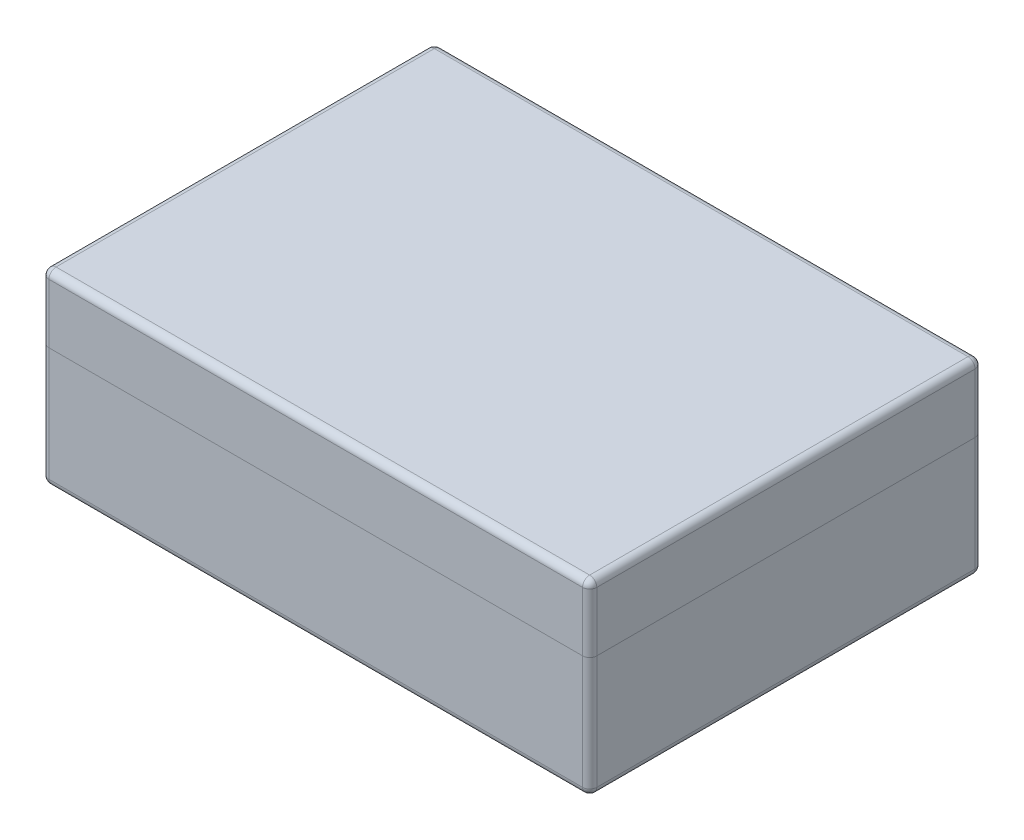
ISO-10303-21;
HEADER;
FILE_DESCRIPTION(('STEP AP214'),'2;1');
FILE_NAME('part.step','',(''),(''),'','','');
FILE_SCHEMA(('AUTOMOTIVE_DESIGN { 1 0 10303 214 1 1 1 1 }'));
ENDSEC;
DATA;
#1=APPLICATION_CONTEXT('core data for automotive mechanical design processes');
#2=APPLICATION_PROTOCOL_DEFINITION('international standard','automotive_design',2000,#1);
#3=PRODUCT_CONTEXT('',#1,'mechanical');
#4=PRODUCT('Part','Part','',(#3));
#5=PRODUCT_RELATED_PRODUCT_CATEGORY('part','',(#4));
#6=PRODUCT_DEFINITION_FORMATION('','',#4);
#7=PRODUCT_DEFINITION_CONTEXT('part definition',#1,'design');
#8=PRODUCT_DEFINITION('design','',#6,#7);
#9=PRODUCT_DEFINITION_SHAPE('','',#8);
#10=(LENGTH_UNIT() NAMED_UNIT(*) SI_UNIT(.MILLI.,.METRE.));
#11=(NAMED_UNIT(*) PLANE_ANGLE_UNIT() SI_UNIT($,.RADIAN.));
#12=(NAMED_UNIT(*) SI_UNIT($,.STERADIAN.) SOLID_ANGLE_UNIT());
#13=UNCERTAINTY_MEASURE_WITH_UNIT(LENGTH_MEASURE(1.E-05),#10,'distance_accuracy_value','');
#14=(GEOMETRIC_REPRESENTATION_CONTEXT(3) GLOBAL_UNCERTAINTY_ASSIGNED_CONTEXT((#13)) GLOBAL_UNIT_ASSIGNED_CONTEXT((#10,
#11,#12)) REPRESENTATION_CONTEXT('',''));
#15=CARTESIAN_POINT('',(0.,0.,0.));
#16=DIRECTION('',(0.,0.,1.));
#17=DIRECTION('',(1.,0.,0.));
#18=AXIS2_PLACEMENT_3D('',#15,#16,#17);
#19=CARTESIAN_POINT('',(0.,102.,0.));
#20=DIRECTION('',(0.,1.,0.));
#21=DIRECTION('',(0.,0.,1.));
#22=AXIS2_PLACEMENT_3D('',#19,#20,#21);
#23=PLANE('',#22);
#24=DIRECTION('',(0.,0.,-1.));
#25=VECTOR('',#24,1.);
#26=CARTESIAN_POINT('',(221.,102.,-155.5));
#27=LINE('',#26,#25);
#28=CARTESIAN_POINT('',(221.,102.,155.5));
#29=VERTEX_POINT('',#28);
#30=CARTESIAN_POINT('',(221.,102.,-155.5));
#31=VERTEX_POINT('',#30);
#32=EDGE_CURVE('E227',#29,#31,#27,.T.);
#33=ORIENTED_EDGE('',*,*,#32,.F.);
#34=DIRECTION('',(1.,0.,0.));
#35=VECTOR('',#34,1.);
#36=CARTESIAN_POINT('',(221.,102.,155.5));
#37=LINE('',#36,#35);
#38=CARTESIAN_POINT('',(-221.,102.,155.5));
#39=VERTEX_POINT('',#38);
#40=EDGE_CURVE('E179',#39,#29,#37,.T.);
#41=ORIENTED_EDGE('',*,*,#40,.F.);
#42=DIRECTION('',(0.,0.,1.));
#43=VECTOR('',#42,1.);
#44=CARTESIAN_POINT('',(-221.,102.,-155.5));
#45=LINE('',#44,#43);
#46=CARTESIAN_POINT('',(-221.,102.,-155.5));
#47=VERTEX_POINT('',#46);
#48=EDGE_CURVE('E223',#47,#39,#45,.T.);
#49=ORIENTED_EDGE('',*,*,#48,.F.);
#50=DIRECTION('',(-1.,0.,0.));
#51=VECTOR('',#50,1.);
#52=CARTESIAN_POINT('',(221.,102.,-155.5));
#53=LINE('',#52,#51);
#54=EDGE_CURVE('E225',#31,#47,#53,.T.);
#55=ORIENTED_EDGE('',*,*,#54,.F.);
#56=EDGE_LOOP('',(#33,#41,#49,#55));
#57=FACE_BOUND('',#56,.T.);
#58=CARTESIAN_POINT('',(225.,102.,159.5));
#59=DIRECTION('',(0.,1.,0.));
#60=DIRECTION('',(0.,0.,1.));
#61=AXIS2_PLACEMENT_3D('',#58,#59,#60);
#62=CIRCLE('',#61,6.);
#63=CARTESIAN_POINT('',(231.,102.,159.5));
#64=VERTEX_POINT('',#63);
#65=CARTESIAN_POINT('',(225.,102.,165.5));
#66=VERTEX_POINT('',#65);
#67=EDGE_CURVE('E150',#64,#66,#62,.F.);
#68=ORIENTED_EDGE('',*,*,#67,.F.);
#69=DIRECTION('',(0.,0.,-1.));
#70=VECTOR('',#69,1.);
#71=CARTESIAN_POINT('',(231.,102.,165.5));
#72=LINE('',#71,#70);
#73=CARTESIAN_POINT('',(231.,102.,-159.5));
#74=VERTEX_POINT('',#73);
#75=EDGE_CURVE('E152',#64,#74,#72,.T.);
#76=ORIENTED_EDGE('',*,*,#75,.T.);
#77=CARTESIAN_POINT('',(225.,102.,-159.5));
#78=DIRECTION('',(0.,1.,0.));
#79=DIRECTION('',(0.,0.,1.));
#80=AXIS2_PLACEMENT_3D('',#77,#78,#79);
#81=CIRCLE('',#80,6.);
#82=CARTESIAN_POINT('',(225.,102.,-165.5));
#83=VERTEX_POINT('',#82);
#84=EDGE_CURVE('E231',#83,#74,#81,.F.);
#85=ORIENTED_EDGE('',*,*,#84,.F.);
#86=DIRECTION('',(-1.,0.,0.));
#87=VECTOR('',#86,1.);
#88=CARTESIAN_POINT('',(-231.,102.,-165.5));
#89=LINE('',#88,#87);
#90=CARTESIAN_POINT('',(-225.,102.,-165.5));
#91=VERTEX_POINT('',#90);
#92=EDGE_CURVE('E169',#83,#91,#89,.T.);
#93=ORIENTED_EDGE('',*,*,#92,.T.);
#94=CARTESIAN_POINT('',(-225.,102.,-159.5));
#95=DIRECTION('',(0.,1.,0.));
#96=DIRECTION('',(0.,0.,1.));
#97=AXIS2_PLACEMENT_3D('',#94,#95,#96);
#98=CIRCLE('',#97,6.);
#99=CARTESIAN_POINT('',(-231.,102.,-159.5));
#100=VERTEX_POINT('',#99);
#101=EDGE_CURVE('E229',#100,#91,#98,.F.);
#102=ORIENTED_EDGE('',*,*,#101,.F.);
#103=DIRECTION('',(0.,0.,1.));
#104=VECTOR('',#103,1.);
#105=CARTESIAN_POINT('',(-231.,102.,165.5));
#106=LINE('',#105,#104);
#107=CARTESIAN_POINT('',(-231.,102.,159.5));
#108=VERTEX_POINT('',#107);
#109=EDGE_CURVE('E161',#100,#108,#106,.T.);
#110=ORIENTED_EDGE('',*,*,#109,.T.);
#111=CARTESIAN_POINT('',(-225.,102.,159.5));
#112=DIRECTION('',(0.,1.,0.));
#113=DIRECTION('',(0.,0.,1.));
#114=AXIS2_PLACEMENT_3D('',#111,#112,#113);
#115=CIRCLE('',#114,6.);
#116=CARTESIAN_POINT('',(-225.,102.,165.5));
#117=VERTEX_POINT('',#116);
#118=EDGE_CURVE('E160',#117,#108,#115,.F.);
#119=ORIENTED_EDGE('',*,*,#118,.F.);
#120=DIRECTION('',(1.,0.,0.));
#121=VECTOR('',#120,1.);
#122=CARTESIAN_POINT('',(-231.,102.,165.5));
#123=LINE('',#122,#121);
#124=EDGE_CURVE('E155',#117,#66,#123,.T.);
#125=ORIENTED_EDGE('',*,*,#124,.T.);
#126=EDGE_LOOP('',(#68,#76,#85,#93,#102,#110,#119,#125));
#127=FACE_BOUND('',#126,.T.);
#128=ADVANCED_FACE('F44',(#57,#127),#23,.T.);
#129=CARTESIAN_POINT('',(221.,147.,-155.5));
#130=DIRECTION('',(0.,0.,1.));
#131=DIRECTION('',(1.,0.,0.));
#132=AXIS2_PLACEMENT_3D('',#129,#130,#131);
#133=PLANE('',#132);
#134=DIRECTION('',(0.,-1.,0.));
#135=VECTOR('',#134,1.);
#136=CARTESIAN_POINT('',(221.,147.,-155.5));
#137=LINE('',#136,#135);
#138=CARTESIAN_POINT('',(221.,7.99999999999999,-155.5));
#139=VERTEX_POINT('',#138);
#140=EDGE_CURVE('E61',#31,#139,#137,.T.);
#141=ORIENTED_EDGE('',*,*,#140,.F.);
#142=ORIENTED_EDGE('',*,*,#54,.T.);
#143=DIRECTION('',(0.,-1.,0.));
#144=VECTOR('',#143,1.);
#145=CARTESIAN_POINT('',(-221.,147.,-155.5));
#146=LINE('',#145,#144);
#147=CARTESIAN_POINT('',(-221.,7.99999999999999,-155.5));
#148=VERTEX_POINT('',#147);
#149=EDGE_CURVE('E68',#47,#148,#146,.T.);
#150=ORIENTED_EDGE('',*,*,#149,.T.);
#151=DIRECTION('',(-1.,0.,0.));
#152=VECTOR('',#151,1.);
#153=CARTESIAN_POINT('',(221.,7.99999999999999,-155.5));
#154=LINE('',#153,#152);
#155=EDGE_CURVE('E53',#139,#148,#154,.T.);
#156=ORIENTED_EDGE('',*,*,#155,.F.);
#157=EDGE_LOOP('',(#141,#142,#150,#156));
#158=FACE_BOUND('',#157,.T.);
#159=ADVANCED_FACE('F338',(#158),#133,.T.);
#160=CARTESIAN_POINT('',(0.,7.99999999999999,0.));
#161=DIRECTION('',(0.,-1.,0.));
#162=DIRECTION('',(0.,0.,-1.));
#163=AXIS2_PLACEMENT_3D('',#160,#161,#162);
#164=PLANE('',#163);
#165=DIRECTION('',(0.,0.,-1.));
#166=VECTOR('',#165,1.);
#167=CARTESIAN_POINT('',(221.,7.99999999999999,-155.5));
#168=LINE('',#167,#166);
#169=CARTESIAN_POINT('',(221.,7.99999999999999,155.5));
#170=VERTEX_POINT('',#169);
#171=EDGE_CURVE('E12',#170,#139,#168,.T.);
#172=ORIENTED_EDGE('',*,*,#171,.T.);
#173=ORIENTED_EDGE('',*,*,#155,.T.);
#174=DIRECTION('',(0.,0.,1.));
#175=VECTOR('',#174,1.);
#176=CARTESIAN_POINT('',(-221.,7.99999999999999,-155.5));
#177=LINE('',#176,#175);
#178=CARTESIAN_POINT('',(-221.,7.99999999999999,155.5));
#179=VERTEX_POINT('',#178);
#180=EDGE_CURVE('E213',#148,#179,#177,.T.);
#181=ORIENTED_EDGE('',*,*,#180,.T.);
#182=DIRECTION('',(1.,0.,0.));
#183=VECTOR('',#182,1.);
#184=CARTESIAN_POINT('',(221.,7.99999999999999,155.5));
#185=LINE('',#184,#183);
#186=EDGE_CURVE('E208',#179,#170,#185,.T.);
#187=ORIENTED_EDGE('',*,*,#186,.T.);
#188=EDGE_LOOP('',(#172,#173,#181,#187));
#189=FACE_BOUND('',#188,.T.);
#190=ADVANCED_FACE('F340',(#189),#164,.F.);
#191=CARTESIAN_POINT('',(221.,147.,-155.5));
#192=DIRECTION('',(-1.,0.,0.));
#193=DIRECTION('',(0.,0.,1.));
#194=AXIS2_PLACEMENT_3D('',#191,#192,#193);
#195=PLANE('',#194);
#196=DIRECTION('',(0.,-1.,0.));
#197=VECTOR('',#196,1.);
#198=CARTESIAN_POINT('',(221.,147.,155.5));
#199=LINE('',#198,#197);
#200=EDGE_CURVE('E48',#29,#170,#199,.T.);
#201=ORIENTED_EDGE('',*,*,#200,.F.);
#202=ORIENTED_EDGE('',*,*,#32,.T.);
#203=ORIENTED_EDGE('',*,*,#140,.T.);
#204=ORIENTED_EDGE('',*,*,#171,.F.);
#205=EDGE_LOOP('',(#201,#202,#203,#204));
#206=FACE_BOUND('',#205,.T.);
#207=ADVANCED_FACE('F346',(#206),#195,.T.);
#208=CARTESIAN_POINT('',(-221.,147.,-155.5));
#209=DIRECTION('',(1.,0.,0.));
#210=DIRECTION('',(0.,0.,-1.));
#211=AXIS2_PLACEMENT_3D('',#208,#209,#210);
#212=PLANE('',#211);
#213=ORIENTED_EDGE('',*,*,#149,.F.);
#214=ORIENTED_EDGE('',*,*,#48,.T.);
#215=DIRECTION('',(0.,-1.,0.));
#216=VECTOR('',#215,1.);
#217=CARTESIAN_POINT('',(-221.,147.,155.5));
#218=LINE('',#217,#216);
#219=EDGE_CURVE('E203',#39,#179,#218,.T.);
#220=ORIENTED_EDGE('',*,*,#219,.T.);
#221=ORIENTED_EDGE('',*,*,#180,.F.);
#222=EDGE_LOOP('',(#213,#214,#220,#221));
#223=FACE_BOUND('',#222,.T.);
#224=ADVANCED_FACE('F352',(#223),#212,.T.);
#225=CARTESIAN_POINT('',(221.,147.,155.5));
#226=DIRECTION('',(0.,0.,-1.));
#227=DIRECTION('',(-1.,0.,0.));
#228=AXIS2_PLACEMENT_3D('',#225,#226,#227);
#229=PLANE('',#228);
#230=ORIENTED_EDGE('',*,*,#219,.F.);
#231=ORIENTED_EDGE('',*,*,#40,.T.);
#232=ORIENTED_EDGE('',*,*,#200,.T.);
#233=ORIENTED_EDGE('',*,*,#186,.F.);
#234=EDGE_LOOP('',(#230,#231,#232,#233));
#235=FACE_BOUND('',#234,.T.);
#236=ADVANCED_FACE('F355',(#235),#229,.T.);
#237=CARTESIAN_POINT('',(0.,0.,0.));
#238=DIRECTION('',(0.,-1.,0.));
#239=DIRECTION('',(0.,0.,-1.));
#240=AXIS2_PLACEMENT_3D('',#237,#238,#239);
#241=PLANE('',#240);
#242=DIRECTION('',(0.,0.,1.));
#243=VECTOR('',#242,1.);
#244=CARTESIAN_POINT('',(-225.,0.,-165.5));
#245=LINE('',#244,#243);
#246=CARTESIAN_POINT('',(-225.,0.,159.5));
#247=VERTEX_POINT('',#246);
#248=CARTESIAN_POINT('',(-225.,0.,-159.5));
#249=VERTEX_POINT('',#248);
#250=EDGE_CURVE('E263',#247,#249,#245,.F.);
#251=ORIENTED_EDGE('',*,*,#250,.T.);
#252=DIRECTION('',(-1.,0.,0.));
#253=VECTOR('',#252,1.);
#254=CARTESIAN_POINT('',(231.,0.,-159.5));
#255=LINE('',#254,#253);
#256=CARTESIAN_POINT('',(225.,0.,-159.5));
#257=VERTEX_POINT('',#256);
#258=EDGE_CURVE('E193',#249,#257,#255,.F.);
#259=ORIENTED_EDGE('',*,*,#258,.T.);
#260=DIRECTION('',(0.,0.,-1.));
#261=VECTOR('',#260,1.);
#262=CARTESIAN_POINT('',(225.,0.,165.5));
#263=LINE('',#262,#261);
#264=CARTESIAN_POINT('',(225.,0.,159.5));
#265=VERTEX_POINT('',#264);
#266=EDGE_CURVE('E291',#257,#265,#263,.F.);
#267=ORIENTED_EDGE('',*,*,#266,.T.);
#268=DIRECTION('',(1.,0.,0.));
#269=VECTOR('',#268,1.);
#270=CARTESIAN_POINT('',(-231.,0.,159.5));
#271=LINE('',#270,#269);
#272=EDGE_CURVE('E290',#265,#247,#271,.F.);
#273=ORIENTED_EDGE('',*,*,#272,.T.);
#274=EDGE_LOOP('',(#251,#259,#267,#273));
#275=FACE_BOUND('',#274,.T.);
#276=ADVANCED_FACE('F320',(#275),#241,.T.);
#277=CARTESIAN_POINT('',(-225.,6.00000000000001,165.5));
#278=DIRECTION('',(0.,0.,-1.));
#279=DIRECTION('',(-1.,0.,0.));
#280=AXIS2_PLACEMENT_3D('',#277,#278,#279);
#281=CYLINDRICAL_SURFACE('',#280,6.);
#282=CARTESIAN_POINT('',(-225.,6.00000000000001,159.5));
#283=DIRECTION('',(0.,0.,1.));
#284=DIRECTION('',(1.,0.,0.));
#285=AXIS2_PLACEMENT_3D('',#282,#283,#284);
#286=CIRCLE('',#285,6.);
#287=CARTESIAN_POINT('',(-231.,6.00000000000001,159.5));
#288=VERTEX_POINT('',#287);
#289=EDGE_CURVE('E255',#247,#288,#286,.F.);
#290=ORIENTED_EDGE('',*,*,#289,.T.);
#291=DIRECTION('',(0.,0.,1.));
#292=VECTOR('',#291,1.);
#293=CARTESIAN_POINT('',(-231.,6.00000000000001,165.5));
#294=LINE('',#293,#292);
#295=CARTESIAN_POINT('',(-231.,6.00000000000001,-159.5));
#296=VERTEX_POINT('',#295);
#297=EDGE_CURVE('E189',#296,#288,#294,.T.);
#298=ORIENTED_EDGE('',*,*,#297,.F.);
#299=CARTESIAN_POINT('',(-225.,6.,-159.5));
#300=DIRECTION('',(0.,0.,-1.));
#301=DIRECTION('',(-1.,0.,0.));
#302=AXIS2_PLACEMENT_3D('',#299,#300,#301);
#303=CIRCLE('',#302,6.);
#304=EDGE_CURVE('E279',#249,#296,#303,.T.);
#305=ORIENTED_EDGE('',*,*,#304,.F.);
#306=ORIENTED_EDGE('',*,*,#250,.F.);
#307=EDGE_LOOP('',(#290,#298,#305,#306));
#308=FACE_BOUND('',#307,.T.);
#309=ADVANCED_FACE('F261',(#308),#281,.T.);
#310=CARTESIAN_POINT('',(-231.,6.00000000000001,159.5));
#311=DIRECTION('',(-1.,0.,0.));
#312=DIRECTION('',(0.,0.,1.));
#313=AXIS2_PLACEMENT_3D('',#310,#311,#312);
#314=CYLINDRICAL_SURFACE('',#313,6.);
#315=CARTESIAN_POINT('',(225.,6.00000000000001,159.5));
#316=DIRECTION('',(1.,0.,0.));
#317=DIRECTION('',(0.,0.,-1.));
#318=AXIS2_PLACEMENT_3D('',#315,#316,#317);
#319=CIRCLE('',#318,6.);
#320=CARTESIAN_POINT('',(225.,6.00000000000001,165.5));
#321=VERTEX_POINT('',#320);
#322=EDGE_CURVE('E200',#321,#265,#319,.T.);
#323=ORIENTED_EDGE('',*,*,#322,.F.);
#324=DIRECTION('',(1.,0.,0.));
#325=VECTOR('',#324,1.);
#326=CARTESIAN_POINT('',(231.,6.00000000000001,165.5));
#327=LINE('',#326,#325);
#328=CARTESIAN_POINT('',(-225.,6.00000000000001,165.5));
#329=VERTEX_POINT('',#328);
#330=EDGE_CURVE('E184',#329,#321,#327,.T.);
#331=ORIENTED_EDGE('',*,*,#330,.F.);
#332=CARTESIAN_POINT('',(-225.,6.,159.5));
#333=DIRECTION('',(-1.,0.,0.));
#334=DIRECTION('',(0.,0.,1.));
#335=AXIS2_PLACEMENT_3D('',#332,#333,#334);
#336=CIRCLE('',#335,6.);
#337=EDGE_CURVE('E258',#247,#329,#336,.T.);
#338=ORIENTED_EDGE('',*,*,#337,.F.);
#339=ORIENTED_EDGE('',*,*,#272,.F.);
#340=EDGE_LOOP('',(#323,#331,#338,#339));
#341=FACE_BOUND('',#340,.T.);
#342=ADVANCED_FACE('F324',(#341),#314,.T.);
#343=CARTESIAN_POINT('',(225.,6.00000000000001,165.5));
#344=DIRECTION('',(0.,0.,1.));
#345=DIRECTION('',(1.,0.,0.));
#346=AXIS2_PLACEMENT_3D('',#343,#344,#345);
#347=CYLINDRICAL_SURFACE('',#346,6.);
#348=CARTESIAN_POINT('',(225.,6.,159.5));
#349=DIRECTION('',(0.,0.,1.));
#350=DIRECTION('',(1.,0.,0.));
#351=AXIS2_PLACEMENT_3D('',#348,#349,#350);
#352=CIRCLE('',#351,6.);
#353=CARTESIAN_POINT('',(231.,6.00000000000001,159.5));
#354=VERTEX_POINT('',#353);
#355=EDGE_CURVE('E265',#354,#265,#352,.F.);
#356=ORIENTED_EDGE('',*,*,#355,.T.);
#357=ORIENTED_EDGE('',*,*,#266,.F.);
#358=CARTESIAN_POINT('',(225.,6.00000000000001,-159.5));
#359=DIRECTION('',(0.,0.,-1.));
#360=DIRECTION('',(-1.,0.,0.));
#361=AXIS2_PLACEMENT_3D('',#358,#359,#360);
#362=CIRCLE('',#361,6.);
#363=CARTESIAN_POINT('',(231.,6.00000000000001,-159.5));
#364=VERTEX_POINT('',#363);
#365=EDGE_CURVE('E264',#364,#257,#362,.T.);
#366=ORIENTED_EDGE('',*,*,#365,.F.);
#367=DIRECTION('',(0.,0.,-1.));
#368=VECTOR('',#367,1.);
#369=CARTESIAN_POINT('',(231.,6.00000000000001,-165.5));
#370=LINE('',#369,#368);
#371=EDGE_CURVE('E175',#354,#364,#370,.T.);
#372=ORIENTED_EDGE('',*,*,#371,.F.);
#373=EDGE_LOOP('',(#356,#357,#366,#372));
#374=FACE_BOUND('',#373,.T.);
#375=ADVANCED_FACE('F318',(#374),#347,.T.);
#376=CARTESIAN_POINT('',(-231.,6.00000000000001,-159.5));
#377=DIRECTION('',(1.,0.,0.));
#378=DIRECTION('',(0.,0.,-1.));
#379=AXIS2_PLACEMENT_3D('',#376,#377,#378);
#380=CYLINDRICAL_SURFACE('',#379,6.);
#381=CARTESIAN_POINT('',(225.,6.,-159.5));
#382=DIRECTION('',(1.,0.,0.));
#383=DIRECTION('',(0.,0.,-1.));
#384=AXIS2_PLACEMENT_3D('',#381,#382,#383);
#385=CIRCLE('',#384,6.);
#386=CARTESIAN_POINT('',(225.,6.00000000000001,-165.5));
#387=VERTEX_POINT('',#386);
#388=EDGE_CURVE('E282',#387,#257,#385,.F.);
#389=ORIENTED_EDGE('',*,*,#388,.T.);
#390=ORIENTED_EDGE('',*,*,#258,.F.);
#391=CARTESIAN_POINT('',(-225.,6.00000000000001,-159.5));
#392=DIRECTION('',(-1.,0.,0.));
#393=DIRECTION('',(0.,0.,1.));
#394=AXIS2_PLACEMENT_3D('',#391,#392,#393);
#395=CIRCLE('',#394,6.);
#396=CARTESIAN_POINT('',(-225.,6.00000000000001,-165.5));
#397=VERTEX_POINT('',#396);
#398=EDGE_CURVE('E202',#249,#397,#395,.F.);
#399=ORIENTED_EDGE('',*,*,#398,.T.);
#400=DIRECTION('',(-1.,0.,0.));
#401=VECTOR('',#400,1.);
#402=CARTESIAN_POINT('',(-231.,6.00000000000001,-165.5));
#403=LINE('',#402,#401);
#404=EDGE_CURVE('E198',#387,#397,#403,.T.);
#405=ORIENTED_EDGE('',*,*,#404,.F.);
#406=EDGE_LOOP('',(#389,#390,#399,#405));
#407=FACE_BOUND('',#406,.T.);
#408=ADVANCED_FACE('F304',(#407),#380,.T.);
#409=CARTESIAN_POINT('',(225.,6.,159.5));
#410=DIRECTION('',(0.,0.,1.));
#411=DIRECTION('',(0.,-1.,0.));
#412=AXIS2_PLACEMENT_3D('',#409,#410,#411);
#413=SPHERICAL_SURFACE('',#412,6.);
#414=CARTESIAN_POINT('',(225.,6.00000000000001,159.5));
#415=DIRECTION('',(0.,-1.,0.));
#416=DIRECTION('',(0.,0.,-1.));
#417=AXIS2_PLACEMENT_3D('',#414,#415,#416);
#418=CIRCLE('',#417,6.);
#419=EDGE_CURVE('E174',#354,#321,#418,.T.);
#420=ORIENTED_EDGE('',*,*,#419,.T.);
#421=ORIENTED_EDGE('',*,*,#322,.T.);
#422=ORIENTED_EDGE('',*,*,#355,.F.);
#423=EDGE_LOOP('',(#420,#421,#422));
#424=FACE_BOUND('',#423,.T.);
#425=ADVANCED_FACE('F328',(#424),#413,.T.);
#426=CARTESIAN_POINT('',(-225.,6.,159.5));
#427=DIRECTION('',(0.,0.,1.));
#428=DIRECTION('',(0.,-1.,0.));
#429=AXIS2_PLACEMENT_3D('',#426,#427,#428);
#430=SPHERICAL_SURFACE('',#429,6.);
#431=ORIENTED_EDGE('',*,*,#337,.T.);
#432=CARTESIAN_POINT('',(-225.,6.00000000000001,159.5));
#433=DIRECTION('',(0.,-1.,0.));
#434=DIRECTION('',(0.,0.,-1.));
#435=AXIS2_PLACEMENT_3D('',#432,#433,#434);
#436=CIRCLE('',#435,6.);
#437=EDGE_CURVE('E248',#329,#288,#436,.T.);
#438=ORIENTED_EDGE('',*,*,#437,.T.);
#439=ORIENTED_EDGE('',*,*,#289,.F.);
#440=EDGE_LOOP('',(#431,#438,#439));
#441=FACE_BOUND('',#440,.T.);
#442=ADVANCED_FACE('F254',(#441),#430,.T.);
#443=CARTESIAN_POINT('',(225.,6.,-159.5));
#444=DIRECTION('',(1.,0.,0.));
#445=DIRECTION('',(0.,1.,0.));
#446=AXIS2_PLACEMENT_3D('',#443,#444,#445);
#447=SPHERICAL_SURFACE('',#446,6.);
#448=CARTESIAN_POINT('',(225.,6.00000000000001,-159.5));
#449=DIRECTION('',(0.,-1.,0.));
#450=DIRECTION('',(0.,0.,-1.));
#451=AXIS2_PLACEMENT_3D('',#448,#449,#450);
#452=CIRCLE('',#451,6.);
#453=EDGE_CURVE('E268',#387,#364,#452,.T.);
#454=ORIENTED_EDGE('',*,*,#453,.T.);
#455=ORIENTED_EDGE('',*,*,#365,.T.);
#456=ORIENTED_EDGE('',*,*,#388,.F.);
#457=EDGE_LOOP('',(#454,#455,#456));
#458=FACE_BOUND('',#457,.T.);
#459=ADVANCED_FACE('F316',(#458),#447,.T.);
#460=CARTESIAN_POINT('',(231.,158.,165.5));
#461=DIRECTION('',(-1.,0.,0.));
#462=DIRECTION('',(0.,0.,1.));
#463=AXIS2_PLACEMENT_3D('',#460,#461,#462);
#464=PLANE('',#463);
#465=ORIENTED_EDGE('',*,*,#75,.F.);
#466=DIRECTION('',(0.,-1.,0.));
#467=VECTOR('',#466,1.);
#468=CARTESIAN_POINT('',(231.,158.,159.5));
#469=LINE('',#468,#467);
#470=EDGE_CURVE('E165',#64,#354,#469,.T.);
#471=ORIENTED_EDGE('',*,*,#470,.T.);
#472=ORIENTED_EDGE('',*,*,#371,.T.);
#473=DIRECTION('',(0.,-1.,0.));
#474=VECTOR('',#473,1.);
#475=CARTESIAN_POINT('',(231.,158.,-159.5));
#476=LINE('',#475,#474);
#477=EDGE_CURVE('E168',#364,#74,#476,.F.);
#478=ORIENTED_EDGE('',*,*,#477,.T.);
#479=EDGE_LOOP('',(#465,#471,#472,#478));
#480=FACE_BOUND('',#479,.T.);
#481=ADVANCED_FACE('F164',(#480),#464,.F.);
#482=CARTESIAN_POINT('',(-225.,6.,-159.5));
#483=DIRECTION('',(-1.,0.,0.));
#484=DIRECTION('',(0.,-1.,0.));
#485=AXIS2_PLACEMENT_3D('',#482,#483,#484);
#486=SPHERICAL_SURFACE('',#485,6.);
#487=ORIENTED_EDGE('',*,*,#304,.T.);
#488=CARTESIAN_POINT('',(-225.,6.00000000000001,-159.5));
#489=DIRECTION('',(0.,-1.,0.));
#490=DIRECTION('',(0.,0.,-1.));
#491=AXIS2_PLACEMENT_3D('',#488,#489,#490);
#492=CIRCLE('',#491,6.);
#493=EDGE_CURVE('E276',#296,#397,#492,.T.);
#494=ORIENTED_EDGE('',*,*,#493,.T.);
#495=ORIENTED_EDGE('',*,*,#398,.F.);
#496=EDGE_LOOP('',(#487,#494,#495));
#497=FACE_BOUND('',#496,.T.);
#498=ADVANCED_FACE('F310',(#497),#486,.T.);
#499=CARTESIAN_POINT('',(-231.,158.,-165.5));
#500=DIRECTION('',(0.,0.,1.));
#501=DIRECTION('',(1.,0.,0.));
#502=AXIS2_PLACEMENT_3D('',#499,#500,#501);
#503=PLANE('',#502);
#504=ORIENTED_EDGE('',*,*,#92,.F.);
#505=DIRECTION('',(0.,-1.,0.));
#506=VECTOR('',#505,1.);
#507=CARTESIAN_POINT('',(225.,158.,-165.5));
#508=LINE('',#507,#506);
#509=EDGE_CURVE('E197',#83,#387,#508,.T.);
#510=ORIENTED_EDGE('',*,*,#509,.T.);
#511=ORIENTED_EDGE('',*,*,#404,.T.);
#512=DIRECTION('',(0.,-1.,0.));
#513=VECTOR('',#512,1.);
#514=CARTESIAN_POINT('',(-225.,158.,-165.5));
#515=LINE('',#514,#513);
#516=EDGE_CURVE('E194',#397,#91,#515,.F.);
#517=ORIENTED_EDGE('',*,*,#516,.T.);
#518=EDGE_LOOP('',(#504,#510,#511,#517));
#519=FACE_BOUND('',#518,.T.);
#520=ADVANCED_FACE('F299',(#519),#503,.F.);
#521=CARTESIAN_POINT('',(-231.,158.,165.5));
#522=DIRECTION('',(1.,0.,0.));
#523=DIRECTION('',(0.,0.,-1.));
#524=AXIS2_PLACEMENT_3D('',#521,#522,#523);
#525=PLANE('',#524);
#526=ORIENTED_EDGE('',*,*,#109,.F.);
#527=DIRECTION('',(0.,-1.,0.));
#528=VECTOR('',#527,1.);
#529=CARTESIAN_POINT('',(-231.,158.,-159.5));
#530=LINE('',#529,#528);
#531=EDGE_CURVE('E187',#100,#296,#530,.T.);
#532=ORIENTED_EDGE('',*,*,#531,.T.);
#533=ORIENTED_EDGE('',*,*,#297,.T.);
#534=DIRECTION('',(0.,-1.,0.));
#535=VECTOR('',#534,1.);
#536=CARTESIAN_POINT('',(-231.,158.,159.5));
#537=LINE('',#536,#535);
#538=EDGE_CURVE('E190',#288,#108,#537,.F.);
#539=ORIENTED_EDGE('',*,*,#538,.T.);
#540=EDGE_LOOP('',(#526,#532,#533,#539));
#541=FACE_BOUND('',#540,.T.);
#542=ADVANCED_FACE('F241',(#541),#525,.F.);
#543=CARTESIAN_POINT('',(-225.,158.,-159.5));
#544=DIRECTION('',(0.,-1.,0.));
#545=DIRECTION('',(0.,0.,-1.));
#546=AXIS2_PLACEMENT_3D('',#543,#544,#545);
#547=CYLINDRICAL_SURFACE('',#546,6.);
#548=ORIENTED_EDGE('',*,*,#531,.F.);
#549=ORIENTED_EDGE('',*,*,#101,.T.);
#550=ORIENTED_EDGE('',*,*,#516,.F.);
#551=ORIENTED_EDGE('',*,*,#493,.F.);
#552=EDGE_LOOP('',(#548,#549,#550,#551));
#553=FACE_BOUND('',#552,.T.);
#554=ADVANCED_FACE('F46',(#553),#547,.T.);
#555=CARTESIAN_POINT('',(225.,158.,-159.5));
#556=DIRECTION('',(0.,-1.,0.));
#557=DIRECTION('',(0.,0.,-1.));
#558=AXIS2_PLACEMENT_3D('',#555,#556,#557);
#559=CYLINDRICAL_SURFACE('',#558,6.);
#560=ORIENTED_EDGE('',*,*,#509,.F.);
#561=ORIENTED_EDGE('',*,*,#84,.T.);
#562=ORIENTED_EDGE('',*,*,#477,.F.);
#563=ORIENTED_EDGE('',*,*,#453,.F.);
#564=EDGE_LOOP('',(#560,#561,#562,#563));
#565=FACE_BOUND('',#564,.T.);
#566=ADVANCED_FACE('F313',(#565),#559,.T.);
#567=CARTESIAN_POINT('',(-231.,158.,165.5));
#568=DIRECTION('',(0.,0.,-1.));
#569=DIRECTION('',(-1.,0.,0.));
#570=AXIS2_PLACEMENT_3D('',#567,#568,#569);
#571=PLANE('',#570);
#572=ORIENTED_EDGE('',*,*,#124,.F.);
#573=DIRECTION('',(0.,-1.,0.));
#574=VECTOR('',#573,1.);
#575=CARTESIAN_POINT('',(-225.,158.,165.5));
#576=LINE('',#575,#574);
#577=EDGE_CURVE('E177',#117,#329,#576,.T.);
#578=ORIENTED_EDGE('',*,*,#577,.T.);
#579=ORIENTED_EDGE('',*,*,#330,.T.);
#580=DIRECTION('',(0.,-1.,0.));
#581=VECTOR('',#580,1.);
#582=CARTESIAN_POINT('',(225.,158.,165.5));
#583=LINE('',#582,#581);
#584=EDGE_CURVE('E185',#321,#66,#583,.F.);
#585=ORIENTED_EDGE('',*,*,#584,.T.);
#586=EDGE_LOOP('',(#572,#578,#579,#585));
#587=FACE_BOUND('',#586,.T.);
#588=ADVANCED_FACE('F360',(#587),#571,.F.);
#589=CARTESIAN_POINT('',(-225.,158.,159.5));
#590=DIRECTION('',(0.,-1.,0.));
#591=DIRECTION('',(0.,0.,-1.));
#592=AXIS2_PLACEMENT_3D('',#589,#590,#591);
#593=CYLINDRICAL_SURFACE('',#592,6.);
#594=ORIENTED_EDGE('',*,*,#577,.F.);
#595=ORIENTED_EDGE('',*,*,#118,.T.);
#596=ORIENTED_EDGE('',*,*,#538,.F.);
#597=ORIENTED_EDGE('',*,*,#437,.F.);
#598=EDGE_LOOP('',(#594,#595,#596,#597));
#599=FACE_BOUND('',#598,.T.);
#600=ADVANCED_FACE('F247',(#599),#593,.T.);
#601=CARTESIAN_POINT('',(225.,158.,159.5));
#602=DIRECTION('',(0.,-1.,0.));
#603=DIRECTION('',(0.,0.,-1.));
#604=AXIS2_PLACEMENT_3D('',#601,#602,#603);
#605=CYLINDRICAL_SURFACE('',#604,6.);
#606=ORIENTED_EDGE('',*,*,#470,.F.);
#607=ORIENTED_EDGE('',*,*,#67,.T.);
#608=ORIENTED_EDGE('',*,*,#584,.F.);
#609=ORIENTED_EDGE('',*,*,#419,.F.);
#610=EDGE_LOOP('',(#606,#607,#608,#609));
#611=FACE_BOUND('',#610,.T.);
#612=ADVANCED_FACE('F172',(#611),#605,.T.);
#613=CLOSED_SHELL('',(#128,#159,#190,#207,#224,#236,#276,#309,#342,#375,#408,#425,#442,#459,
#481,#498,#520,#542,#554,#566,#588,#600,#612));
#614=MANIFOLD_SOLID_BREP('B2',#613);
#615=CARTESIAN_POINT('',(0.,102.,0.));
#616=DIRECTION('',(0.,1.,0.));
#617=DIRECTION('',(0.,0.,1.));
#618=AXIS2_PLACEMENT_3D('',#615,#616,#617);
#619=PLANE('',#618);
#620=CARTESIAN_POINT('',(225.,102.,159.5));
#621=DIRECTION('',(0.,1.,0.));
#622=DIRECTION('',(0.,0.,1.));
#623=AXIS2_PLACEMENT_3D('',#620,#621,#622);
#624=CIRCLE('',#623,6.);
#625=CARTESIAN_POINT('',(231.,102.,159.5));
#626=VERTEX_POINT('',#625);
#627=CARTESIAN_POINT('',(225.,102.,165.5));
#628=VERTEX_POINT('',#627);
#629=EDGE_CURVE('E525',#626,#628,#624,.F.);
#630=ORIENTED_EDGE('',*,*,#629,.T.);
#631=DIRECTION('',(1.,0.,0.));
#632=VECTOR('',#631,1.);
#633=CARTESIAN_POINT('',(-231.,102.,165.5));
#634=LINE('',#633,#632);
#635=CARTESIAN_POINT('',(-225.,102.,165.5));
#636=VERTEX_POINT('',#635);
#637=EDGE_CURVE('E734',#636,#628,#634,.T.);
#638=ORIENTED_EDGE('',*,*,#637,.F.);
#639=CARTESIAN_POINT('',(-225.,102.,159.5));
#640=DIRECTION('',(0.,1.,0.));
#641=DIRECTION('',(0.,0.,1.));
#642=AXIS2_PLACEMENT_3D('',#639,#640,#641);
#643=CIRCLE('',#642,6.);
#644=CARTESIAN_POINT('',(-231.,102.,159.5));
#645=VERTEX_POINT('',#644);
#646=EDGE_CURVE('E737',#636,#645,#643,.F.);
#647=ORIENTED_EDGE('',*,*,#646,.T.);
#648=DIRECTION('',(0.,0.,1.));
#649=VECTOR('',#648,1.);
#650=CARTESIAN_POINT('',(-231.,102.,165.5));
#651=LINE('',#650,#649);
#652=CARTESIAN_POINT('',(-231.,102.,-159.5));
#653=VERTEX_POINT('',#652);
#654=EDGE_CURVE('E732',#653,#645,#651,.T.);
#655=ORIENTED_EDGE('',*,*,#654,.F.);
#656=CARTESIAN_POINT('',(-225.,102.,-159.5));
#657=DIRECTION('',(0.,1.,0.));
#658=DIRECTION('',(0.,0.,1.));
#659=AXIS2_PLACEMENT_3D('',#656,#657,#658);
#660=CIRCLE('',#659,6.);
#661=CARTESIAN_POINT('',(-225.,102.,-165.5));
#662=VERTEX_POINT('',#661);
#663=EDGE_CURVE('E726',#653,#662,#660,.F.);
#664=ORIENTED_EDGE('',*,*,#663,.T.);
#665=DIRECTION('',(-1.,0.,0.));
#666=VECTOR('',#665,1.);
#667=CARTESIAN_POINT('',(-231.,102.,-165.5));
#668=LINE('',#667,#666);
#669=CARTESIAN_POINT('',(225.,102.,-165.5));
#670=VERTEX_POINT('',#669);
#671=EDGE_CURVE('E690',#670,#662,#668,.T.);
#672=ORIENTED_EDGE('',*,*,#671,.F.);
#673=CARTESIAN_POINT('',(225.,102.,-159.5));
#674=DIRECTION('',(0.,1.,0.));
#675=DIRECTION('',(0.,0.,1.));
#676=AXIS2_PLACEMENT_3D('',#673,#674,#675);
#677=CIRCLE('',#676,6.);
#678=CARTESIAN_POINT('',(231.,102.,-159.5));
#679=VERTEX_POINT('',#678);
#680=EDGE_CURVE('E729',#670,#679,#677,.F.);
#681=ORIENTED_EDGE('',*,*,#680,.T.);
#682=DIRECTION('',(0.,0.,-1.));
#683=VECTOR('',#682,1.);
#684=CARTESIAN_POINT('',(231.,102.,165.5));
#685=LINE('',#684,#683);
#686=EDGE_CURVE('E731',#626,#679,#685,.T.);
#687=ORIENTED_EDGE('',*,*,#686,.F.);
#688=EDGE_LOOP('',(#630,#638,#647,#655,#664,#672,#681,#687));
#689=FACE_BOUND('',#688,.T.);
#690=DIRECTION('',(0.,0.,-1.));
#691=VECTOR('',#690,1.);
#692=CARTESIAN_POINT('',(221.,102.,-155.5));
#693=LINE('',#692,#691);
#694=CARTESIAN_POINT('',(221.,102.,155.5));
#695=VERTEX_POINT('',#694);
#696=CARTESIAN_POINT('',(221.,102.,-155.5));
#697=VERTEX_POINT('',#696);
#698=EDGE_CURVE('E724',#695,#697,#693,.T.);
#699=ORIENTED_EDGE('',*,*,#698,.T.);
#700=DIRECTION('',(-1.,0.,0.));
#701=VECTOR('',#700,1.);
#702=CARTESIAN_POINT('',(221.,102.,-155.5));
#703=LINE('',#702,#701);
#704=CARTESIAN_POINT('',(-221.,102.,-155.5));
#705=VERTEX_POINT('',#704);
#706=EDGE_CURVE('E642',#697,#705,#703,.T.);
#707=ORIENTED_EDGE('',*,*,#706,.T.);
#708=DIRECTION('',(0.,0.,1.));
#709=VECTOR('',#708,1.);
#710=CARTESIAN_POINT('',(-221.,102.,-155.5));
#711=LINE('',#710,#709);
#712=CARTESIAN_POINT('',(-221.,102.,155.5));
#713=VERTEX_POINT('',#712);
#714=EDGE_CURVE('E530',#705,#713,#711,.T.);
#715=ORIENTED_EDGE('',*,*,#714,.T.);
#716=DIRECTION('',(1.,0.,0.));
#717=VECTOR('',#716,1.);
#718=CARTESIAN_POINT('',(221.,102.,155.5));
#719=LINE('',#718,#717);
#720=EDGE_CURVE('E42',#713,#695,#719,.T.);
#721=ORIENTED_EDGE('',*,*,#720,.T.);
#722=EDGE_LOOP('',(#699,#707,#715,#721));
#723=FACE_BOUND('',#722,.T.);
#724=ADVANCED_FACE('F522',(#689,#723),#619,.F.);
#725=CARTESIAN_POINT('',(221.,147.,-155.5));
#726=DIRECTION('',(-1.,0.,0.));
#727=DIRECTION('',(0.,0.,1.));
#728=AXIS2_PLACEMENT_3D('',#725,#726,#727);
#729=PLANE('',#728);
#730=ORIENTED_EDGE('',*,*,#698,.F.);
#731=DIRECTION('',(0.,-1.,0.));
#732=VECTOR('',#731,1.);
#733=CARTESIAN_POINT('',(221.,147.,155.5));
#734=LINE('',#733,#732);
#735=CARTESIAN_POINT('',(221.,147.,155.5));
#736=VERTEX_POINT('',#735);
#737=EDGE_CURVE('E638',#736,#695,#734,.T.);
#738=ORIENTED_EDGE('',*,*,#737,.F.);
#739=DIRECTION('',(0.,0.,-1.));
#740=VECTOR('',#739,1.);
#741=CARTESIAN_POINT('',(221.,147.,-155.5));
#742=LINE('',#741,#740);
#743=CARTESIAN_POINT('',(221.,147.,-155.5));
#744=VERTEX_POINT('',#743);
#745=EDGE_CURVE('E626',#736,#744,#742,.T.);
#746=ORIENTED_EDGE('',*,*,#745,.T.);
#747=DIRECTION('',(0.,-1.,0.));
#748=VECTOR('',#747,1.);
#749=CARTESIAN_POINT('',(221.,147.,-155.5));
#750=LINE('',#749,#748);
#751=EDGE_CURVE('E637',#744,#697,#750,.T.);
#752=ORIENTED_EDGE('',*,*,#751,.T.);
#753=EDGE_LOOP('',(#730,#738,#746,#752));
#754=FACE_BOUND('',#753,.T.);
#755=ADVANCED_FACE('F636',(#754),#729,.T.);
#756=CARTESIAN_POINT('',(221.,147.,-155.5));
#757=DIRECTION('',(0.,0.,1.));
#758=DIRECTION('',(1.,0.,0.));
#759=AXIS2_PLACEMENT_3D('',#756,#757,#758);
#760=PLANE('',#759);
#761=ORIENTED_EDGE('',*,*,#706,.F.);
#762=ORIENTED_EDGE('',*,*,#751,.F.);
#763=DIRECTION('',(-1.,0.,0.));
#764=VECTOR('',#763,1.);
#765=CARTESIAN_POINT('',(221.,147.,-155.5));
#766=LINE('',#765,#764);
#767=CARTESIAN_POINT('',(-221.,147.,-155.5));
#768=VERTEX_POINT('',#767);
#769=EDGE_CURVE('E622',#744,#768,#766,.T.);
#770=ORIENTED_EDGE('',*,*,#769,.T.);
#771=DIRECTION('',(0.,-1.,0.));
#772=VECTOR('',#771,1.);
#773=CARTESIAN_POINT('',(-221.,147.,-155.5));
#774=LINE('',#773,#772);
#775=EDGE_CURVE('E644',#768,#705,#774,.T.);
#776=ORIENTED_EDGE('',*,*,#775,.T.);
#777=EDGE_LOOP('',(#761,#762,#770,#776));
#778=FACE_BOUND('',#777,.T.);
#779=ADVANCED_FACE('F640',(#778),#760,.T.);
#780=CARTESIAN_POINT('',(-221.,147.,-155.5));
#781=DIRECTION('',(1.,0.,0.));
#782=DIRECTION('',(0.,0.,-1.));
#783=AXIS2_PLACEMENT_3D('',#780,#781,#782);
#784=PLANE('',#783);
#785=ORIENTED_EDGE('',*,*,#714,.F.);
#786=ORIENTED_EDGE('',*,*,#775,.F.);
#787=DIRECTION('',(0.,0.,1.));
#788=VECTOR('',#787,1.);
#789=CARTESIAN_POINT('',(-221.,147.,-155.5));
#790=LINE('',#789,#788);
#791=CARTESIAN_POINT('',(-221.,147.,155.5));
#792=VERTEX_POINT('',#791);
#793=EDGE_CURVE('E627',#768,#792,#790,.T.);
#794=ORIENTED_EDGE('',*,*,#793,.T.);
#795=DIRECTION('',(0.,-1.,0.));
#796=VECTOR('',#795,1.);
#797=CARTESIAN_POINT('',(-221.,147.,155.5));
#798=LINE('',#797,#796);
#799=EDGE_CURVE('E649',#792,#713,#798,.T.);
#800=ORIENTED_EDGE('',*,*,#799,.T.);
#801=EDGE_LOOP('',(#785,#786,#794,#800));
#802=FACE_BOUND('',#801,.T.);
#803=ADVANCED_FACE('F856',(#802),#784,.T.);
#804=CARTESIAN_POINT('',(221.,147.,155.5));
#805=DIRECTION('',(0.,0.,-1.));
#806=DIRECTION('',(-1.,0.,0.));
#807=AXIS2_PLACEMENT_3D('',#804,#805,#806);
#808=PLANE('',#807);
#809=ORIENTED_EDGE('',*,*,#720,.F.);
#810=ORIENTED_EDGE('',*,*,#799,.F.);
#811=DIRECTION('',(1.,0.,0.));
#812=VECTOR('',#811,1.);
#813=CARTESIAN_POINT('',(221.,147.,155.5));
#814=LINE('',#813,#812);
#815=EDGE_CURVE('E994',#792,#736,#814,.T.);
#816=ORIENTED_EDGE('',*,*,#815,.T.);
#817=ORIENTED_EDGE('',*,*,#737,.T.);
#818=EDGE_LOOP('',(#809,#810,#816,#817));
#819=FACE_BOUND('',#818,.T.);
#820=ADVANCED_FACE('F859',(#819),#808,.T.);
#821=CARTESIAN_POINT('',(0.,147.,0.));
#822=DIRECTION('',(0.,-1.,0.));
#823=DIRECTION('',(0.,0.,-1.));
#824=AXIS2_PLACEMENT_3D('',#821,#822,#823);
#825=PLANE('',#824);
#826=ORIENTED_EDGE('',*,*,#745,.F.);
#827=ORIENTED_EDGE('',*,*,#815,.F.);
#828=ORIENTED_EDGE('',*,*,#793,.F.);
#829=ORIENTED_EDGE('',*,*,#769,.F.);
#830=EDGE_LOOP('',(#826,#827,#828,#829));
#831=FACE_BOUND('',#830,.T.);
#832=ADVANCED_FACE('F624',(#831),#825,.T.);
#833=CARTESIAN_POINT('',(-231.,158.,165.5));
#834=DIRECTION('',(1.,0.,0.));
#835=DIRECTION('',(0.,0.,-1.));
#836=AXIS2_PLACEMENT_3D('',#833,#834,#835);
#837=PLANE('',#836);
#838=DIRECTION('',(0.,-1.,0.));
#839=VECTOR('',#838,1.);
#840=CARTESIAN_POINT('',(-231.,158.,-159.5));
#841=LINE('',#840,#839);
#842=CARTESIAN_POINT('',(-231.,152.,-159.5));
#843=VERTEX_POINT('',#842);
#844=EDGE_CURVE('E665',#843,#653,#841,.T.);
#845=ORIENTED_EDGE('',*,*,#844,.T.);
#846=ORIENTED_EDGE('',*,*,#654,.T.);
#847=DIRECTION('',(0.,-1.,0.));
#848=VECTOR('',#847,1.);
#849=CARTESIAN_POINT('',(-231.,158.,159.5));
#850=LINE('',#849,#848);
#851=CARTESIAN_POINT('',(-231.,152.,159.5));
#852=VERTEX_POINT('',#851);
#853=EDGE_CURVE('E663',#645,#852,#850,.F.);
#854=ORIENTED_EDGE('',*,*,#853,.T.);
#855=DIRECTION('',(0.,0.,1.));
#856=VECTOR('',#855,1.);
#857=CARTESIAN_POINT('',(-231.,152.,165.5));
#858=LINE('',#857,#856);
#859=EDGE_CURVE('E661',#852,#843,#858,.F.);
#860=ORIENTED_EDGE('',*,*,#859,.T.);
#861=EDGE_LOOP('',(#845,#846,#854,#860));
#862=FACE_BOUND('',#861,.T.);
#863=ADVANCED_FACE('F775',(#862),#837,.F.);
#864=CARTESIAN_POINT('',(-231.,158.,165.5));
#865=DIRECTION('',(0.,0.,-1.));
#866=DIRECTION('',(-1.,0.,0.));
#867=AXIS2_PLACEMENT_3D('',#864,#865,#866);
#868=PLANE('',#867);
#869=DIRECTION('',(0.,-1.,0.));
#870=VECTOR('',#869,1.);
#871=CARTESIAN_POINT('',(-225.,158.,165.5));
#872=LINE('',#871,#870);
#873=CARTESIAN_POINT('',(-225.,152.,165.5));
#874=VERTEX_POINT('',#873);
#875=EDGE_CURVE('E672',#874,#636,#872,.T.);
#876=ORIENTED_EDGE('',*,*,#875,.T.);
#877=ORIENTED_EDGE('',*,*,#637,.T.);
#878=DIRECTION('',(0.,-1.,0.));
#879=VECTOR('',#878,1.);
#880=CARTESIAN_POINT('',(225.,158.,165.5));
#881=LINE('',#880,#879);
#882=CARTESIAN_POINT('',(225.,152.,165.5));
#883=VERTEX_POINT('',#882);
#884=EDGE_CURVE('E670',#628,#883,#881,.F.);
#885=ORIENTED_EDGE('',*,*,#884,.T.);
#886=DIRECTION('',(1.,0.,0.));
#887=VECTOR('',#886,1.);
#888=CARTESIAN_POINT('',(-231.,152.,165.5));
#889=LINE('',#888,#887);
#890=EDGE_CURVE('E668',#883,#874,#889,.F.);
#891=ORIENTED_EDGE('',*,*,#890,.T.);
#892=EDGE_LOOP('',(#876,#877,#885,#891));
#893=FACE_BOUND('',#892,.T.);
#894=ADVANCED_FACE('F743',(#893),#868,.F.);
#895=CARTESIAN_POINT('',(231.,158.,165.5));
#896=DIRECTION('',(-1.,0.,0.));
#897=DIRECTION('',(0.,0.,1.));
#898=AXIS2_PLACEMENT_3D('',#895,#896,#897);
#899=PLANE('',#898);
#900=DIRECTION('',(0.,-1.,0.));
#901=VECTOR('',#900,1.);
#902=CARTESIAN_POINT('',(231.,158.,159.5));
#903=LINE('',#902,#901);
#904=CARTESIAN_POINT('',(231.,152.,159.5));
#905=VERTEX_POINT('',#904);
#906=EDGE_CURVE('E679',#905,#626,#903,.T.);
#907=ORIENTED_EDGE('',*,*,#906,.T.);
#908=ORIENTED_EDGE('',*,*,#686,.T.);
#909=DIRECTION('',(0.,-1.,0.));
#910=VECTOR('',#909,1.);
#911=CARTESIAN_POINT('',(231.,158.,-159.5));
#912=LINE('',#911,#910);
#913=CARTESIAN_POINT('',(231.,152.,-159.5));
#914=VERTEX_POINT('',#913);
#915=EDGE_CURVE('E677',#679,#914,#912,.F.);
#916=ORIENTED_EDGE('',*,*,#915,.T.);
#917=DIRECTION('',(0.,0.,-1.));
#918=VECTOR('',#917,1.);
#919=CARTESIAN_POINT('',(231.,152.,165.5));
#920=LINE('',#919,#918);
#921=EDGE_CURVE('E675',#914,#905,#920,.F.);
#922=ORIENTED_EDGE('',*,*,#921,.T.);
#923=EDGE_LOOP('',(#907,#908,#916,#922));
#924=FACE_BOUND('',#923,.T.);
#925=ADVANCED_FACE('F807',(#924),#899,.F.);
#926=CARTESIAN_POINT('',(-231.,158.,-165.5));
#927=DIRECTION('',(0.,0.,1.));
#928=DIRECTION('',(1.,0.,0.));
#929=AXIS2_PLACEMENT_3D('',#926,#927,#928);
#930=PLANE('',#929);
#931=DIRECTION('',(0.,-1.,0.));
#932=VECTOR('',#931,1.);
#933=CARTESIAN_POINT('',(225.,158.,-165.5));
#934=LINE('',#933,#932);
#935=CARTESIAN_POINT('',(225.,152.,-165.5));
#936=VERTEX_POINT('',#935);
#937=EDGE_CURVE('E655',#936,#670,#934,.T.);
#938=ORIENTED_EDGE('',*,*,#937,.T.);
#939=ORIENTED_EDGE('',*,*,#671,.T.);
#940=DIRECTION('',(0.,-1.,0.));
#941=VECTOR('',#940,1.);
#942=CARTESIAN_POINT('',(-225.,158.,-165.5));
#943=LINE('',#942,#941);
#944=CARTESIAN_POINT('',(-225.,152.,-165.5));
#945=VERTEX_POINT('',#944);
#946=EDGE_CURVE('E659',#662,#945,#943,.F.);
#947=ORIENTED_EDGE('',*,*,#946,.T.);
#948=DIRECTION('',(-1.,0.,0.));
#949=VECTOR('',#948,1.);
#950=CARTESIAN_POINT('',(-231.,152.,-165.5));
#951=LINE('',#950,#949);
#952=EDGE_CURVE('E653',#945,#936,#951,.F.);
#953=ORIENTED_EDGE('',*,*,#952,.T.);
#954=EDGE_LOOP('',(#938,#939,#947,#953));
#955=FACE_BOUND('',#954,.T.);
#956=ADVANCED_FACE('F782',(#955),#930,.F.);
#957=CARTESIAN_POINT('',(0.,158.,0.));
#958=DIRECTION('',(0.,-1.,0.));
#959=DIRECTION('',(0.,0.,-1.));
#960=AXIS2_PLACEMENT_3D('',#957,#958,#959);
#961=PLANE('',#960);
#962=DIRECTION('',(0.,0.,-1.));
#963=VECTOR('',#962,1.);
#964=CARTESIAN_POINT('',(225.,158.,0.));
#965=LINE('',#964,#963);
#966=CARTESIAN_POINT('',(225.,158.,159.5));
#967=VERTEX_POINT('',#966);
#968=CARTESIAN_POINT('',(225.,158.,-159.5));
#969=VERTEX_POINT('',#968);
#970=EDGE_CURVE('E686',#967,#969,#965,.T.);
#971=ORIENTED_EDGE('',*,*,#970,.T.);
#972=DIRECTION('',(-1.,0.,0.));
#973=VECTOR('',#972,1.);
#974=CARTESIAN_POINT('',(0.,158.,-159.5));
#975=LINE('',#974,#973);
#976=CARTESIAN_POINT('',(-225.,158.,-159.5));
#977=VERTEX_POINT('',#976);
#978=EDGE_CURVE('E688',#969,#977,#975,.T.);
#979=ORIENTED_EDGE('',*,*,#978,.T.);
#980=DIRECTION('',(0.,0.,1.));
#981=VECTOR('',#980,1.);
#982=CARTESIAN_POINT('',(-225.,158.,0.));
#983=LINE('',#982,#981);
#984=CARTESIAN_POINT('',(-225.,158.,159.5));
#985=VERTEX_POINT('',#984);
#986=EDGE_CURVE('E682',#977,#985,#983,.T.);
#987=ORIENTED_EDGE('',*,*,#986,.T.);
#988=DIRECTION('',(1.,0.,0.));
#989=VECTOR('',#988,1.);
#990=CARTESIAN_POINT('',(0.,158.,159.5));
#991=LINE('',#990,#989);
#992=EDGE_CURVE('E684',#985,#967,#991,.T.);
#993=ORIENTED_EDGE('',*,*,#992,.T.);
#994=EDGE_LOOP('',(#971,#979,#987,#993));
#995=FACE_BOUND('',#994,.T.);
#996=ADVANCED_FACE('F795',(#995),#961,.F.);
#997=CARTESIAN_POINT('',(0.,152.,159.5));
#998=DIRECTION('',(1.,0.,0.));
#999=DIRECTION('',(0.,0.,-1.));
#1000=AXIS2_PLACEMENT_3D('',#997,#998,#999);
#1001=CYLINDRICAL_SURFACE('',#1000,6.);
#1002=CARTESIAN_POINT('',(225.,152.,159.5));
#1003=DIRECTION('',(1.,0.,0.));
#1004=DIRECTION('',(0.,0.,-1.));
#1005=AXIS2_PLACEMENT_3D('',#1002,#1003,#1004);
#1006=CIRCLE('',#1005,6.);
#1007=EDGE_CURVE('E656',#967,#883,#1006,.T.);
#1008=ORIENTED_EDGE('',*,*,#1007,.F.);
#1009=ORIENTED_EDGE('',*,*,#992,.F.);
#1010=CARTESIAN_POINT('',(-225.,152.,159.5));
#1011=DIRECTION('',(-1.,0.,0.));
#1012=DIRECTION('',(0.,0.,1.));
#1013=AXIS2_PLACEMENT_3D('',#1010,#1011,#1012);
#1014=CIRCLE('',#1013,6.);
#1015=EDGE_CURVE('E717',#874,#985,#1014,.T.);
#1016=ORIENTED_EDGE('',*,*,#1015,.F.);
#1017=ORIENTED_EDGE('',*,*,#890,.F.);
#1018=EDGE_LOOP('',(#1008,#1009,#1016,#1017));
#1019=FACE_BOUND('',#1018,.T.);
#1020=ADVANCED_FACE('F760',(#1019),#1001,.T.);
#1021=CARTESIAN_POINT('',(225.,152.,159.5));
#1022=DIRECTION('',(0.,0.,1.));
#1023=DIRECTION('',(1.,0.,0.));
#1024=AXIS2_PLACEMENT_3D('',#1021,#1022,#1023);
#1025=SPHERICAL_SURFACE('',#1024,6.);
#1026=CARTESIAN_POINT('',(225.,152.,159.5));
#1027=DIRECTION('',(0.,0.,1.));
#1028=DIRECTION('',(1.,0.,0.));
#1029=AXIS2_PLACEMENT_3D('',#1026,#1027,#1028);
#1030=CIRCLE('',#1029,6.);
#1031=EDGE_CURVE('E711',#967,#905,#1030,.F.);
#1032=ORIENTED_EDGE('',*,*,#1031,.F.);
#1033=ORIENTED_EDGE('',*,*,#1007,.T.);
#1034=CARTESIAN_POINT('',(225.,152.,159.5));
#1035=DIRECTION('',(0.,1.,0.));
#1036=DIRECTION('',(0.,0.,1.));
#1037=AXIS2_PLACEMENT_3D('',#1034,#1035,#1036);
#1038=CIRCLE('',#1037,6.);
#1039=EDGE_CURVE('E714',#905,#883,#1038,.F.);
#1040=ORIENTED_EDGE('',*,*,#1039,.F.);
#1041=EDGE_LOOP('',(#1032,#1033,#1040));
#1042=FACE_BOUND('',#1041,.T.);
#1043=ADVANCED_FACE('F755',(#1042),#1025,.T.);
#1044=CARTESIAN_POINT('',(-225.,152.,159.5));
#1045=DIRECTION('',(0.,1.,0.));
#1046=DIRECTION('',(0.,0.,1.));
#1047=AXIS2_PLACEMENT_3D('',#1044,#1045,#1046);
#1048=SPHERICAL_SURFACE('',#1047,6.);
#1049=CARTESIAN_POINT('',(-225.,152.,159.5));
#1050=DIRECTION('',(0.,1.,0.));
#1051=DIRECTION('',(0.,0.,1.));
#1052=AXIS2_PLACEMENT_3D('',#1049,#1050,#1051);
#1053=CIRCLE('',#1052,6.);
#1054=EDGE_CURVE('E705',#874,#852,#1053,.F.);
#1055=ORIENTED_EDGE('',*,*,#1054,.F.);
#1056=ORIENTED_EDGE('',*,*,#1015,.T.);
#1057=CARTESIAN_POINT('',(-225.,152.,159.5));
#1058=DIRECTION('',(0.,0.,1.));
#1059=DIRECTION('',(1.,0.,0.));
#1060=AXIS2_PLACEMENT_3D('',#1057,#1058,#1059);
#1061=CIRCLE('',#1060,6.);
#1062=EDGE_CURVE('E708',#852,#985,#1061,.F.);
#1063=ORIENTED_EDGE('',*,*,#1062,.F.);
#1064=EDGE_LOOP('',(#1055,#1056,#1063));
#1065=FACE_BOUND('',#1064,.T.);
#1066=ADVANCED_FACE('F765',(#1065),#1048,.T.);
#1067=CARTESIAN_POINT('',(225.,158.,159.5));
#1068=DIRECTION('',(0.,-1.,0.));
#1069=DIRECTION('',(0.,0.,-1.));
#1070=AXIS2_PLACEMENT_3D('',#1067,#1068,#1069);
#1071=CYLINDRICAL_SURFACE('',#1070,6.);
#1072=ORIENTED_EDGE('',*,*,#629,.F.);
#1073=ORIENTED_EDGE('',*,*,#906,.F.);
#1074=ORIENTED_EDGE('',*,*,#1039,.T.);
#1075=ORIENTED_EDGE('',*,*,#884,.F.);
#1076=EDGE_LOOP('',(#1072,#1073,#1074,#1075));
#1077=FACE_BOUND('',#1076,.T.);
#1078=ADVANCED_FACE('F751',(#1077),#1071,.T.);
#1079=CARTESIAN_POINT('',(225.,152.,0.));
#1080=DIRECTION('',(0.,0.,-1.));
#1081=DIRECTION('',(-1.,0.,0.));
#1082=AXIS2_PLACEMENT_3D('',#1079,#1080,#1081);
#1083=CYLINDRICAL_SURFACE('',#1082,6.);
#1084=ORIENTED_EDGE('',*,*,#1031,.T.);
#1085=ORIENTED_EDGE('',*,*,#921,.F.);
#1086=CARTESIAN_POINT('',(225.,152.,-159.5));
#1087=DIRECTION('',(0.,0.,-1.));
#1088=DIRECTION('',(-1.,0.,0.));
#1089=AXIS2_PLACEMENT_3D('',#1086,#1087,#1088);
#1090=CIRCLE('',#1089,6.);
#1091=EDGE_CURVE('E702',#969,#914,#1090,.T.);
#1092=ORIENTED_EDGE('',*,*,#1091,.F.);
#1093=ORIENTED_EDGE('',*,*,#970,.F.);
#1094=EDGE_LOOP('',(#1084,#1085,#1092,#1093));
#1095=FACE_BOUND('',#1094,.T.);
#1096=ADVANCED_FACE('F799',(#1095),#1083,.T.);
#1097=CARTESIAN_POINT('',(0.,152.,-159.5));
#1098=DIRECTION('',(-1.,0.,0.));
#1099=DIRECTION('',(0.,0.,1.));
#1100=AXIS2_PLACEMENT_3D('',#1097,#1098,#1099);
#1101=CYLINDRICAL_SURFACE('',#1100,6.);
#1102=CARTESIAN_POINT('',(-225.,152.,-159.5));
#1103=DIRECTION('',(-1.,0.,0.));
#1104=DIRECTION('',(0.,0.,1.));
#1105=AXIS2_PLACEMENT_3D('',#1102,#1103,#1104);
#1106=CIRCLE('',#1105,6.);
#1107=EDGE_CURVE('E696',#977,#945,#1106,.T.);
#1108=ORIENTED_EDGE('',*,*,#1107,.F.);
#1109=ORIENTED_EDGE('',*,*,#978,.F.);
#1110=CARTESIAN_POINT('',(225.,152.,-159.5));
#1111=DIRECTION('',(1.,0.,0.));
#1112=DIRECTION('',(0.,1.,0.));
#1113=AXIS2_PLACEMENT_3D('',#1110,#1111,#1112);
#1114=CIRCLE('',#1113,6.);
#1115=EDGE_CURVE('E699',#936,#969,#1114,.T.);
#1116=ORIENTED_EDGE('',*,*,#1115,.F.);
#1117=ORIENTED_EDGE('',*,*,#952,.F.);
#1118=EDGE_LOOP('',(#1108,#1109,#1116,#1117));
#1119=FACE_BOUND('',#1118,.T.);
#1120=ADVANCED_FACE('F786',(#1119),#1101,.T.);
#1121=CARTESIAN_POINT('',(-225.,152.,0.));
#1122=DIRECTION('',(0.,0.,1.));
#1123=DIRECTION('',(1.,0.,0.));
#1124=AXIS2_PLACEMENT_3D('',#1121,#1122,#1123);
#1125=CYLINDRICAL_SURFACE('',#1124,6.);
#1126=ORIENTED_EDGE('',*,*,#1062,.T.);
#1127=ORIENTED_EDGE('',*,*,#986,.F.);
#1128=CARTESIAN_POINT('',(-225.,152.,-159.5));
#1129=DIRECTION('',(0.,0.,-1.));
#1130=DIRECTION('',(-1.,0.,0.));
#1131=AXIS2_PLACEMENT_3D('',#1128,#1129,#1130);
#1132=CIRCLE('',#1131,6.);
#1133=EDGE_CURVE('E694',#843,#977,#1132,.T.);
#1134=ORIENTED_EDGE('',*,*,#1133,.F.);
#1135=ORIENTED_EDGE('',*,*,#859,.F.);
#1136=EDGE_LOOP('',(#1126,#1127,#1134,#1135));
#1137=FACE_BOUND('',#1136,.T.);
#1138=ADVANCED_FACE('F793',(#1137),#1125,.T.);
#1139=CARTESIAN_POINT('',(-225.,158.,159.5));
#1140=DIRECTION('',(0.,-1.,0.));
#1141=DIRECTION('',(0.,0.,-1.));
#1142=AXIS2_PLACEMENT_3D('',#1139,#1140,#1141);
#1143=CYLINDRICAL_SURFACE('',#1142,6.);
#1144=ORIENTED_EDGE('',*,*,#646,.F.);
#1145=ORIENTED_EDGE('',*,*,#875,.F.);
#1146=ORIENTED_EDGE('',*,*,#1054,.T.);
#1147=ORIENTED_EDGE('',*,*,#853,.F.);
#1148=EDGE_LOOP('',(#1144,#1145,#1146,#1147));
#1149=FACE_BOUND('',#1148,.T.);
#1150=ADVANCED_FACE('F769',(#1149),#1143,.T.);
#1151=CARTESIAN_POINT('',(225.,152.,-159.5));
#1152=DIRECTION('',(0.,1.,0.));
#1153=DIRECTION('',(0.,0.,1.));
#1154=AXIS2_PLACEMENT_3D('',#1151,#1152,#1153);
#1155=SPHERICAL_SURFACE('',#1154,6.);
#1156=ORIENTED_EDGE('',*,*,#1115,.T.);
#1157=ORIENTED_EDGE('',*,*,#1091,.T.);
#1158=CARTESIAN_POINT('',(225.,152.,-159.5));
#1159=DIRECTION('',(0.,1.,0.));
#1160=DIRECTION('',(0.,0.,1.));
#1161=AXIS2_PLACEMENT_3D('',#1158,#1159,#1160);
#1162=CIRCLE('',#1161,6.);
#1163=EDGE_CURVE('E647',#936,#914,#1162,.F.);
#1164=ORIENTED_EDGE('',*,*,#1163,.F.);
#1165=EDGE_LOOP('',(#1156,#1157,#1164));
#1166=FACE_BOUND('',#1165,.T.);
#1167=ADVANCED_FACE('F801',(#1166),#1155,.T.);
#1168=CARTESIAN_POINT('',(-225.,152.,-159.5));
#1169=DIRECTION('',(0.,1.,0.));
#1170=DIRECTION('',(0.,0.,1.));
#1171=AXIS2_PLACEMENT_3D('',#1168,#1169,#1170);
#1172=SPHERICAL_SURFACE('',#1171,6.);
#1173=ORIENTED_EDGE('',*,*,#1133,.T.);
#1174=ORIENTED_EDGE('',*,*,#1107,.T.);
#1175=CARTESIAN_POINT('',(-225.,152.,-159.5));
#1176=DIRECTION('',(0.,1.,0.));
#1177=DIRECTION('',(0.,0.,1.));
#1178=AXIS2_PLACEMENT_3D('',#1175,#1176,#1177);
#1179=CIRCLE('',#1178,6.);
#1180=EDGE_CURVE('E643',#843,#945,#1179,.F.);
#1181=ORIENTED_EDGE('',*,*,#1180,.F.);
#1182=EDGE_LOOP('',(#1173,#1174,#1181));
#1183=FACE_BOUND('',#1182,.T.);
#1184=ADVANCED_FACE('F791',(#1183),#1172,.T.);
#1185=CARTESIAN_POINT('',(225.,158.,-159.5));
#1186=DIRECTION('',(0.,-1.,0.));
#1187=DIRECTION('',(0.,0.,-1.));
#1188=AXIS2_PLACEMENT_3D('',#1185,#1186,#1187);
#1189=CYLINDRICAL_SURFACE('',#1188,6.);
#1190=ORIENTED_EDGE('',*,*,#680,.F.);
#1191=ORIENTED_EDGE('',*,*,#937,.F.);
#1192=ORIENTED_EDGE('',*,*,#1163,.T.);
#1193=ORIENTED_EDGE('',*,*,#915,.F.);
#1194=EDGE_LOOP('',(#1190,#1191,#1192,#1193));
#1195=FACE_BOUND('',#1194,.T.);
#1196=ADVANCED_FACE('F805',(#1195),#1189,.T.);
#1197=CARTESIAN_POINT('',(-225.,158.,-159.5));
#1198=DIRECTION('',(0.,-1.,0.));
#1199=DIRECTION('',(0.,0.,-1.));
#1200=AXIS2_PLACEMENT_3D('',#1197,#1198,#1199);
#1201=CYLINDRICAL_SURFACE('',#1200,6.);
#1202=ORIENTED_EDGE('',*,*,#663,.F.);
#1203=ORIENTED_EDGE('',*,*,#844,.F.);
#1204=ORIENTED_EDGE('',*,*,#1180,.T.);
#1205=ORIENTED_EDGE('',*,*,#946,.F.);
#1206=EDGE_LOOP('',(#1202,#1203,#1204,#1205));
#1207=FACE_BOUND('',#1206,.T.);
#1208=ADVANCED_FACE('F778',(#1207),#1201,.T.);
#1209=CLOSED_SHELL('',(#724,#755,#779,#803,#820,#832,#863,#894,#925,#956,#996,#1020,#1043,#1066,
#1078,#1096,#1120,#1138,#1150,#1167,#1184,#1196,#1208));
#1210=MANIFOLD_SOLID_BREP('B6',#1209);
#1211=ADVANCED_BREP_SHAPE_REPRESENTATION('',(#18,#614,#1210),#14);
#1212=SHAPE_DEFINITION_REPRESENTATION(#9,#1211);
ENDSEC;
END-ISO-10303-21;
